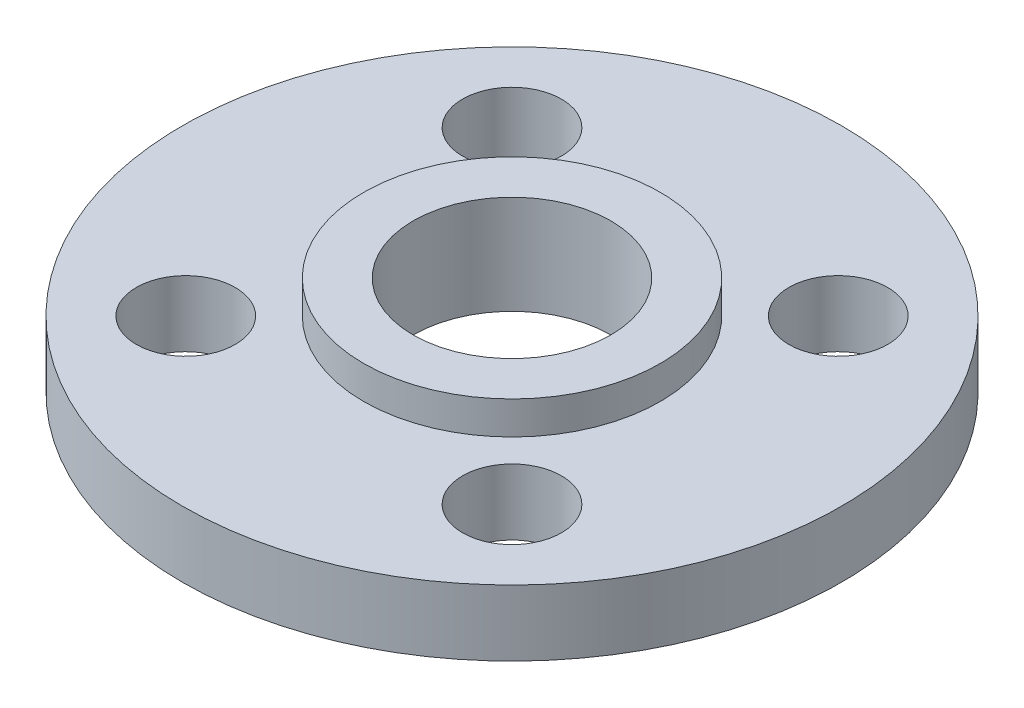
from build123d import *

# Parameters (mm, degrees)
SKETCH1_R           = 10
SKETCH1_R_2         = 1.5
SKETCH1_R_3         = 3
BOSS_EXTRUDE1_DEPTH = 2
SKETCH2_R           = 4.5
SKETCH2_R_2         = 3
BOSS_EXTRUDE2_DEPTH = 1


with BuildPart() as part:
    # Sketch1 → Boss-Extrude1 (new body)
    with BuildSketch(Plane(origin=(0, 0, 0), x_dir=(1, 0, 0), z_dir=(0, 1, 0))):
        with Locations(Location((0, 0, 0), (0, 0, 270))):
            Circle(SKETCH1_R)
        with Locations(Location((4.949747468, 4.949747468, 0), (0, 0, 270))):
            Circle(SKETCH1_R_2, mode=Mode.SUBTRACT)
        with Locations(Location((4.949747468, -4.949747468, 0), (0, 0, 270))):
            Circle(SKETCH1_R_2, mode=Mode.SUBTRACT)
        with Locations(Location((-4.949747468, -4.949747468, 0), (0, 0, 270))):
            Circle(SKETCH1_R_2, mode=Mode.SUBTRACT)
        with Locations(Location((-4.949747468, 4.949747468, 0), (0, 0, 270))):
            Circle(SKETCH1_R_2, mode=Mode.SUBTRACT)
        with Locations(Location((0, 0, 0), (0, 0, 270))):
            Circle(SKETCH1_R_3, mode=Mode.SUBTRACT)
    extrude(amount=BOSS_EXTRUDE1_DEPTH)

    # Sketch2 → Boss-Extrude2 (add)
    with BuildSketch(Plane(origin=(0, 2, 0), x_dir=(1, 0, 0), z_dir=(0, 1, 0))):
        with Locations(Location((0, 0, 0), (0, 0, 270))):
            Circle(SKETCH2_R)
        with Locations(Location((0, 0, 0), (0, 0, 270))):
            Circle(SKETCH2_R_2, mode=Mode.SUBTRACT)
    extrude(amount=BOSS_EXTRUDE2_DEPTH)


solid = part.part
